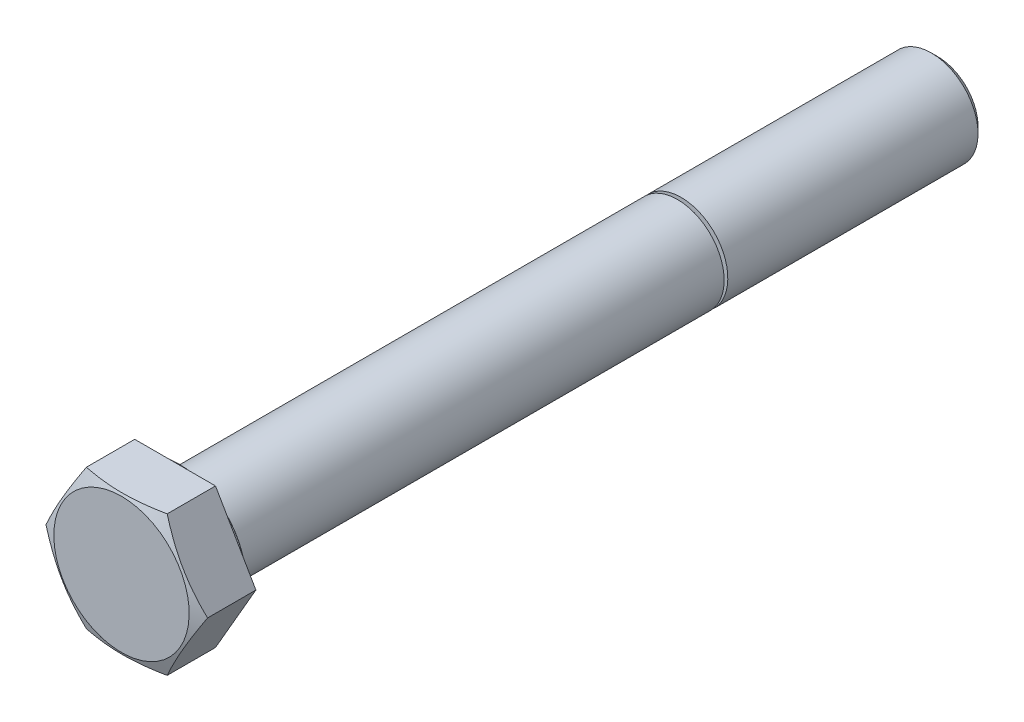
ISO-10303-21;
HEADER;
FILE_DESCRIPTION(('STEP AP214'),'2;1');
FILE_NAME('part.step','',(''),(''),'','','');
FILE_SCHEMA(('AUTOMOTIVE_DESIGN { 1 0 10303 214 1 1 1 1 }'));
ENDSEC;
DATA;
#1=APPLICATION_CONTEXT('core data for automotive mechanical design processes');
#2=APPLICATION_PROTOCOL_DEFINITION('international standard','automotive_design',2000,#1);
#3=PRODUCT_CONTEXT('',#1,'mechanical');
#4=PRODUCT('Part','Part','',(#3));
#5=PRODUCT_RELATED_PRODUCT_CATEGORY('part','',(#4));
#6=PRODUCT_DEFINITION_FORMATION('','',#4);
#7=PRODUCT_DEFINITION_CONTEXT('part definition',#1,'design');
#8=PRODUCT_DEFINITION('design','',#6,#7);
#9=PRODUCT_DEFINITION_SHAPE('','',#8);
#10=(LENGTH_UNIT() NAMED_UNIT(*) SI_UNIT(.MILLI.,.METRE.));
#11=(NAMED_UNIT(*) PLANE_ANGLE_UNIT() SI_UNIT($,.RADIAN.));
#12=(NAMED_UNIT(*) SI_UNIT($,.STERADIAN.) SOLID_ANGLE_UNIT());
#13=UNCERTAINTY_MEASURE_WITH_UNIT(LENGTH_MEASURE(1.E-05),#10,'distance_accuracy_value','');
#14=(GEOMETRIC_REPRESENTATION_CONTEXT(3) GLOBAL_UNCERTAINTY_ASSIGNED_CONTEXT((#13)) GLOBAL_UNIT_ASSIGNED_CONTEXT((#10,
#11,#12)) REPRESENTATION_CONTEXT('',''));
#15=CARTESIAN_POINT('',(0.,0.,0.));
#16=DIRECTION('',(0.,0.,1.));
#17=DIRECTION('',(1.,0.,0.));
#18=AXIS2_PLACEMENT_3D('',#15,#16,#17);
#19=CARTESIAN_POINT('',(0.,3.45875,-130.));
#20=DIRECTION('',(0.,0.,-1.));
#21=DIRECTION('',(0.,1.,0.));
#22=AXIS2_PLACEMENT_3D('',#19,#20,#21);
#23=PLANE('',#22);
#24=CARTESIAN_POINT('',(0.,0.,-130.));
#25=DIRECTION('',(0.,0.,-1.));
#26=DIRECTION('',(0.,1.,0.));
#27=AXIS2_PLACEMENT_3D('',#24,#25,#26);
#28=CIRCLE('',#27,6.9175);
#29=CARTESIAN_POINT('',(0.,6.9175,-130.));
#30=VERTEX_POINT('',#29);
#31=EDGE_CURVE('E11',#30,#30,#28,.T.);
#32=ORIENTED_EDGE('',*,*,#31,.T.);
#33=EDGE_LOOP('',(#32));
#34=FACE_BOUND('',#33,.T.);
#35=ADVANCED_FACE('F17',(#34),#23,.T.);
#36=CARTESIAN_POINT('',(0.,0.,-129.45875));
#37=DIRECTION('',(0.,0.,1.));
#38=DIRECTION('',(0.,1.,0.));
#39=AXIS2_PLACEMENT_3D('',#36,#37,#38);
#40=CONICAL_SURFACE('',#39,7.45875,0.785398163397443);
#41=CARTESIAN_POINT('',(0.,0.,-128.9175));
#42=DIRECTION('',(0.,0.,-1.));
#43=DIRECTION('',(0.,1.,0.));
#44=AXIS2_PLACEMENT_3D('',#41,#42,#43);
#45=CIRCLE('',#44,8.);
#46=CARTESIAN_POINT('',(0.,8.,-128.9175));
#47=VERTEX_POINT('',#46);
#48=EDGE_CURVE('E28',#47,#47,#45,.T.);
#49=ORIENTED_EDGE('',*,*,#48,.T.);
#50=EDGE_LOOP('',(#49));
#51=FACE_BOUND('',#50,.T.);
#52=ORIENTED_EDGE('',*,*,#31,.F.);
#53=EDGE_LOOP('',(#52));
#54=FACE_BOUND('',#53,.T.);
#55=ADVANCED_FACE('F259',(#51,#54),#40,.T.);
#56=CARTESIAN_POINT('',(0.,0.,-107.45875));
#57=DIRECTION('',(0.,0.,1.));
#58=DIRECTION('',(0.,1.,0.));
#59=AXIS2_PLACEMENT_3D('',#56,#57,#58);
#60=CYLINDRICAL_SURFACE('',#59,8.);
#61=CARTESIAN_POINT('',(0.,0.,-86.));
#62=DIRECTION('',(0.,0.,-1.));
#63=DIRECTION('',(0.,1.,0.));
#64=AXIS2_PLACEMENT_3D('',#61,#62,#63);
#65=CIRCLE('',#64,8.);
#66=CARTESIAN_POINT('',(0.,8.,-86.));
#67=VERTEX_POINT('',#66);
#68=EDGE_CURVE('E99',#67,#67,#65,.T.);
#69=ORIENTED_EDGE('',*,*,#68,.T.);
#70=EDGE_LOOP('',(#69));
#71=FACE_BOUND('',#70,.T.);
#72=ORIENTED_EDGE('',*,*,#48,.F.);
#73=EDGE_LOOP('',(#72));
#74=FACE_BOUND('',#73,.T.);
#75=ADVANCED_FACE('F245',(#71,#74),#60,.T.);
#76=CARTESIAN_POINT('',(0.,7.45875,-86.));
#77=DIRECTION('',(0.,0.,1.));
#78=DIRECTION('',(0.,-1.,0.));
#79=AXIS2_PLACEMENT_3D('',#76,#77,#78);
#80=PLANE('',#79);
#81=CARTESIAN_POINT('',(0.,0.,-86.));
#82=DIRECTION('',(0.,0.,-1.));
#83=DIRECTION('',(0.,1.,0.));
#84=AXIS2_PLACEMENT_3D('',#81,#82,#83);
#85=CIRCLE('',#84,6.9175);
#86=CARTESIAN_POINT('',(0.,6.9175,-86.));
#87=VERTEX_POINT('',#86);
#88=EDGE_CURVE('E94',#87,#87,#85,.T.);
#89=ORIENTED_EDGE('',*,*,#88,.T.);
#90=EDGE_LOOP('',(#89));
#91=FACE_BOUND('',#90,.T.);
#92=ORIENTED_EDGE('',*,*,#68,.F.);
#93=EDGE_LOOP('',(#92));
#94=FACE_BOUND('',#93,.T.);
#95=ADVANCED_FACE('F248',(#91,#94),#80,.T.);
#96=CARTESIAN_POINT('',(0.,0.,-85.6875091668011));
#97=DIRECTION('',(0.,0.,1.));
#98=DIRECTION('',(0.,1.,0.));
#99=AXIS2_PLACEMENT_3D('',#96,#97,#98);
#100=CONICAL_SURFACE('',#99,7.45875,1.0471975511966);
#101=CARTESIAN_POINT('',(0.,0.,-85.3750183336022));
#102=DIRECTION('',(0.,0.,-1.));
#103=DIRECTION('',(0.,1.,0.));
#104=AXIS2_PLACEMENT_3D('',#101,#102,#103);
#105=CIRCLE('',#104,8.);
#106=CARTESIAN_POINT('',(0.,8.,-85.3750183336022));
#107=VERTEX_POINT('',#106);
#108=EDGE_CURVE('E89',#107,#107,#105,.T.);
#109=ORIENTED_EDGE('',*,*,#108,.T.);
#110=EDGE_LOOP('',(#109));
#111=FACE_BOUND('',#110,.T.);
#112=ORIENTED_EDGE('',*,*,#88,.F.);
#113=EDGE_LOOP('',(#112));
#114=FACE_BOUND('',#113,.T.);
#115=ADVANCED_FACE('F90',(#111,#114),#100,.T.);
#116=CARTESIAN_POINT('',(0.,0.,-43.0875091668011));
#117=DIRECTION('',(0.,0.,1.));
#118=DIRECTION('',(0.,1.,0.));
#119=AXIS2_PLACEMENT_3D('',#116,#117,#118);
#120=CYLINDRICAL_SURFACE('',#119,8.);
#121=CARTESIAN_POINT('',(0.,0.,-0.8));
#122=DIRECTION('',(0.,0.,-1.));
#123=DIRECTION('',(0.,1.,0.));
#124=AXIS2_PLACEMENT_3D('',#121,#122,#123);
#125=CIRCLE('',#124,8.);
#126=CARTESIAN_POINT('',(0.,8.,-0.8));
#127=VERTEX_POINT('',#126);
#128=EDGE_CURVE('E85',#127,#127,#125,.T.);
#129=ORIENTED_EDGE('',*,*,#128,.T.);
#130=EDGE_LOOP('',(#129));
#131=FACE_BOUND('',#130,.T.);
#132=ORIENTED_EDGE('',*,*,#108,.F.);
#133=EDGE_LOOP('',(#132));
#134=FACE_BOUND('',#133,.T.);
#135=ADVANCED_FACE('F257',(#131,#134),#120,.T.);
#136=CARTESIAN_POINT('',(0.,0.,-0.8));
#137=DIRECTION('',(0.,0.,-1.));
#138=DIRECTION('',(-1.,0.,0.));
#139=AXIS2_PLACEMENT_3D('',#136,#137,#138);
#140=TOROIDAL_SURFACE('',#139,8.8,0.8);
#141=CARTESIAN_POINT('',(0.,0.,0.));
#142=DIRECTION('',(0.,0.,-1.));
#143=DIRECTION('',(0.,1.,0.));
#144=AXIS2_PLACEMENT_3D('',#141,#142,#143);
#145=CIRCLE('',#144,8.8);
#146=CARTESIAN_POINT('',(0.,8.8,0.));
#147=VERTEX_POINT('',#146);
#148=EDGE_CURVE('E101',#147,#147,#145,.T.);
#149=ORIENTED_EDGE('',*,*,#148,.T.);
#150=EDGE_LOOP('',(#149));
#151=FACE_BOUND('',#150,.T.);
#152=ORIENTED_EDGE('',*,*,#128,.F.);
#153=EDGE_LOOP('',(#152));
#154=FACE_BOUND('',#153,.T.);
#155=ADVANCED_FACE('F273',(#151,#154),#140,.F.);
#156=CARTESIAN_POINT('',(0.,9.9,0.));
#157=DIRECTION('',(0.,0.,-1.));
#158=DIRECTION('',(0.,1.,0.));
#159=AXIS2_PLACEMENT_3D('',#156,#157,#158);
#160=PLANE('',#159);
#161=CARTESIAN_POINT('',(0.,0.,0.));
#162=DIRECTION('',(0.,0.,-1.));
#163=DIRECTION('',(0.,1.,0.));
#164=AXIS2_PLACEMENT_3D('',#161,#162,#163);
#165=CIRCLE('',#164,11.);
#166=CARTESIAN_POINT('',(0.,11.,0.));
#167=VERTEX_POINT('',#166);
#168=EDGE_CURVE('E105',#167,#167,#165,.T.);
#169=ORIENTED_EDGE('',*,*,#168,.T.);
#170=EDGE_LOOP('',(#169));
#171=FACE_BOUND('',#170,.T.);
#172=ORIENTED_EDGE('',*,*,#148,.F.);
#173=EDGE_LOOP('',(#172));
#174=FACE_BOUND('',#173,.T.);
#175=ADVANCED_FACE('F276',(#171,#174),#160,.T.);
#176=CARTESIAN_POINT('',(0.,0.,0.8));
#177=DIRECTION('',(0.,0.,-1.));
#178=DIRECTION('',(-1.,0.,0.));
#179=AXIS2_PLACEMENT_3D('',#176,#177,#178);
#180=TOROIDAL_SURFACE('',#179,11.,0.8);
#181=CARTESIAN_POINT('',(0.,0.,0.8));
#182=DIRECTION('',(0.,0.,-1.));
#183=DIRECTION('',(0.,1.,0.));
#184=AXIS2_PLACEMENT_3D('',#181,#182,#183);
#185=CIRCLE('',#184,11.8);
#186=CARTESIAN_POINT('',(0.,11.8,0.8));
#187=VERTEX_POINT('',#186);
#188=EDGE_CURVE('E56',#187,#187,#185,.T.);
#189=ORIENTED_EDGE('',*,*,#188,.T.);
#190=EDGE_LOOP('',(#189));
#191=FACE_BOUND('',#190,.T.);
#192=ORIENTED_EDGE('',*,*,#168,.F.);
#193=EDGE_LOOP('',(#192));
#194=FACE_BOUND('',#193,.T.);
#195=ADVANCED_FACE('F284',(#191,#194),#180,.T.);
#196=CARTESIAN_POINT('',(0.,12.8282,0.8));
#197=DIRECTION('',(0.,0.,-1.));
#198=DIRECTION('',(0.,1.,0.));
#199=AXIS2_PLACEMENT_3D('',#196,#197,#198);
#200=PLANE('',#199);
#201=ORIENTED_EDGE('',*,*,#188,.F.);
#202=EDGE_LOOP('',(#201));
#203=FACE_BOUND('',#202,.T.);
#204=DIRECTION('',(0.5,-0.866025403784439,0.));
#205=VECTOR('',#204,1.);
#206=CARTESIAN_POINT('',(-13.1696867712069,-1.18942220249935,0.8));
#207=LINE('',#206,#205);
#208=CARTESIAN_POINT('',(-13.8564,0.,0.8));
#209=VERTEX_POINT('',#208);
#210=CARTESIAN_POINT('',(-6.9282,-11.9999944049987,0.8));
#211=VERTEX_POINT('',#210);
#212=EDGE_CURVE('E122',#209,#211,#207,.T.);
#213=ORIENTED_EDGE('',*,*,#212,.F.);
#214=DIRECTION('',(-0.5,-0.866025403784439,0.));
#215=VECTOR('',#214,1.);
#216=CARTESIAN_POINT('',(-7.61491322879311,10.8105722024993,0.8));
#217=LINE('',#216,#215);
#218=CARTESIAN_POINT('',(-6.9282,11.9999944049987,0.8));
#219=VERTEX_POINT('',#218);
#220=EDGE_CURVE('E21',#219,#209,#217,.T.);
#221=ORIENTED_EDGE('',*,*,#220,.F.);
#222=DIRECTION('',(-1.,0.,0.));
#223=VECTOR('',#222,1.);
#224=CARTESIAN_POINT('',(0.,11.9999944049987,0.8));
#225=LINE('',#224,#223);
#226=CARTESIAN_POINT('',(6.9282,11.9999944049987,0.8));
#227=VERTEX_POINT('',#226);
#228=EDGE_CURVE('E158',#227,#219,#225,.T.);
#229=ORIENTED_EDGE('',*,*,#228,.F.);
#230=DIRECTION('',(-0.5,0.866025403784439,0.));
#231=VECTOR('',#230,1.);
#232=CARTESIAN_POINT('',(7.61491322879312,10.8105722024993,0.8));
#233=LINE('',#232,#231);
#234=CARTESIAN_POINT('',(13.8564,0.,0.8));
#235=VERTEX_POINT('',#234);
#236=EDGE_CURVE('E131',#235,#227,#233,.T.);
#237=ORIENTED_EDGE('',*,*,#236,.F.);
#238=DIRECTION('',(0.5,0.866025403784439,0.));
#239=VECTOR('',#238,1.);
#240=CARTESIAN_POINT('',(13.1696867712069,-1.18942220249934,0.8));
#241=LINE('',#240,#239);
#242=CARTESIAN_POINT('',(6.9282,-11.9999944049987,0.8));
#243=VERTEX_POINT('',#242);
#244=EDGE_CURVE('E156',#243,#235,#241,.T.);
#245=ORIENTED_EDGE('',*,*,#244,.F.);
#246=DIRECTION('',(1.,0.,0.));
#247=VECTOR('',#246,1.);
#248=CARTESIAN_POINT('',(0.,-11.9999944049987,0.8));
#249=LINE('',#248,#247);
#250=EDGE_CURVE('E114',#211,#243,#249,.T.);
#251=ORIENTED_EDGE('',*,*,#250,.F.);
#252=EDGE_LOOP('',(#213,#221,#229,#237,#245,#251));
#253=FACE_BOUND('',#252,.T.);
#254=ADVANCED_FACE('F236',(#203,#253),#200,.T.);
#255=CARTESIAN_POINT('',(0.,0.,9.54545454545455));
#256=DIRECTION('',(0.,0.,-1.));
#257=DIRECTION('',(0.,1.,0.));
#258=AXIS2_PLACEMENT_3D('',#255,#256,#257);
#259=CONICAL_SURFACE('',#258,12.7313605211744,1.18682389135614);
#260=CARTESIAN_POINT('',(0.,0.,10.));
#261=DIRECTION('',(0.,0.,-1.));
#262=DIRECTION('',(0.,1.,0.));
#263=AXIS2_PLACEMENT_3D('',#260,#261,#262);
#264=CIRCLE('',#263,11.6063210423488);
#265=CARTESIAN_POINT('',(0.,11.6063210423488,10.));
#266=VERTEX_POINT('',#265);
#267=EDGE_CURVE('E63',#266,#266,#264,.T.);
#268=ORIENTED_EDGE('',*,*,#267,.T.);
#269=EDGE_LOOP('',(#268));
#270=FACE_BOUND('',#269,.T.);
#271=CARTESIAN_POINT('',(6.9282,-11.9999944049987,9.09090909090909));
#272=CARTESIAN_POINT('',(0.,-11.9999944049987,10.4904963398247));
#273=CARTESIAN_POINT('',(-6.9282,-11.9999944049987,9.09090909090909));
#274=(BOUNDED_CURVE() B_SPLINE_CURVE(2,(#271,#272,#273),.UNSPECIFIED.,.F.,
.F.) B_SPLINE_CURVE_WITH_KNOTS((3,3),(0.,13.9373613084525),
.UNSPECIFIED.) CURVE() GEOMETRIC_REPRESENTATION_ITEM() RATIONAL_B_SPLINE_CURVE((1.,
1.15470053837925,1.)) REPRESENTATION_ITEM(''));
#275=CARTESIAN_POINT('',(6.9282,-11.9999944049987,9.09090909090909));
#276=VERTEX_POINT('',#275);
#277=CARTESIAN_POINT('',(-6.9282,-11.9999944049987,9.09090909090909));
#278=VERTEX_POINT('',#277);
#279=EDGE_CURVE('E181',#276,#278,#274,.T.);
#280=ORIENTED_EDGE('',*,*,#279,.F.);
#281=CARTESIAN_POINT('',(13.8564,0.,9.09090909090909));
#282=CARTESIAN_POINT('',(10.3923,-5.99999720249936,10.4904963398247));
#283=CARTESIAN_POINT('',(6.9282,-11.9999944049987,9.09090909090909));
#284=(BOUNDED_CURVE() B_SPLINE_CURVE(2,(#281,#282,#283),.UNSPECIFIED.,.F.,
.F.) B_SPLINE_CURVE_WITH_KNOTS((3,3),(0.,13.9373613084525),
.UNSPECIFIED.) CURVE() GEOMETRIC_REPRESENTATION_ITEM() RATIONAL_B_SPLINE_CURVE((1.,
1.15470053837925,1.)) REPRESENTATION_ITEM(''));
#285=CARTESIAN_POINT('',(13.8564,0.,9.09090909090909));
#286=VERTEX_POINT('',#285);
#287=EDGE_CURVE('E139',#286,#276,#284,.T.);
#288=ORIENTED_EDGE('',*,*,#287,.F.);
#289=CARTESIAN_POINT('',(6.9282,11.9999944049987,9.09090909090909));
#290=CARTESIAN_POINT('',(10.3923,5.99999720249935,10.4904963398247));
#291=CARTESIAN_POINT('',(13.8564,0.,9.09090909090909));
#292=(BOUNDED_CURVE() B_SPLINE_CURVE(2,(#289,#290,#291),.UNSPECIFIED.,.F.,
.F.) B_SPLINE_CURVE_WITH_KNOTS((3,3),(0.,13.9373613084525),
.UNSPECIFIED.) CURVE() GEOMETRIC_REPRESENTATION_ITEM() RATIONAL_B_SPLINE_CURVE((1.,
1.15470053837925,1.)) REPRESENTATION_ITEM(''));
#293=CARTESIAN_POINT('',(6.9282,11.9999944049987,9.09090909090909));
#294=VERTEX_POINT('',#293);
#295=EDGE_CURVE('E127',#294,#286,#292,.T.);
#296=ORIENTED_EDGE('',*,*,#295,.F.);
#297=CARTESIAN_POINT('',(-6.9282,11.9999944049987,9.09090909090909));
#298=CARTESIAN_POINT('',(0.,11.9999944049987,10.4904963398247));
#299=CARTESIAN_POINT('',(6.9282,11.9999944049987,9.09090909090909));
#300=(BOUNDED_CURVE() B_SPLINE_CURVE(2,(#297,#298,#299),.UNSPECIFIED.,.F.,
.F.) B_SPLINE_CURVE_WITH_KNOTS((3,3),(0.,13.9373613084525),
.UNSPECIFIED.) CURVE() GEOMETRIC_REPRESENTATION_ITEM() RATIONAL_B_SPLINE_CURVE((1.,
1.15470053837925,1.)) REPRESENTATION_ITEM(''));
#301=CARTESIAN_POINT('',(-6.9282,11.9999944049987,9.09090909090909));
#302=VERTEX_POINT('',#301);
#303=EDGE_CURVE('E169',#302,#294,#300,.T.);
#304=ORIENTED_EDGE('',*,*,#303,.F.);
#305=CARTESIAN_POINT('',(-13.8564,0.,9.09090909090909));
#306=CARTESIAN_POINT('',(-10.3923,5.99999720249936,10.4904963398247));
#307=CARTESIAN_POINT('',(-6.9282,11.9999944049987,9.09090909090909));
#308=(BOUNDED_CURVE() B_SPLINE_CURVE(2,(#305,#306,#307),.UNSPECIFIED.,.F.,
.F.) B_SPLINE_CURVE_WITH_KNOTS((3,3),(0.,13.9373613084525),
.UNSPECIFIED.) CURVE() GEOMETRIC_REPRESENTATION_ITEM() RATIONAL_B_SPLINE_CURVE((1.,
1.15470053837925,1.)) REPRESENTATION_ITEM(''));
#309=CARTESIAN_POINT('',(-13.8564,0.,9.09090909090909));
#310=VERTEX_POINT('',#309);
#311=EDGE_CURVE('E125',#310,#302,#308,.T.);
#312=ORIENTED_EDGE('',*,*,#311,.F.);
#313=CARTESIAN_POINT('',(-6.9282,-11.9999944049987,9.09090909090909));
#314=CARTESIAN_POINT('',(-10.3923,-5.99999720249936,10.4904963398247));
#315=CARTESIAN_POINT('',(-13.8564,0.,9.09090909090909));
#316=(BOUNDED_CURVE() B_SPLINE_CURVE(2,(#313,#314,#315),.UNSPECIFIED.,.F.,
.F.) B_SPLINE_CURVE_WITH_KNOTS((3,3),(0.,13.9373613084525),
.UNSPECIFIED.) CURVE() GEOMETRIC_REPRESENTATION_ITEM() RATIONAL_B_SPLINE_CURVE((1.,
1.15470053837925,1.)) REPRESENTATION_ITEM(''));
#317=EDGE_CURVE('E109',#278,#310,#316,.T.);
#318=ORIENTED_EDGE('',*,*,#317,.F.);
#319=EDGE_LOOP('',(#280,#288,#296,#304,#312,#318));
#320=FACE_BOUND('',#319,.T.);
#321=ADVANCED_FACE('F19',(#270,#320),#259,.T.);
#322=CARTESIAN_POINT('',(0.,5.80316052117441,10.));
#323=DIRECTION('',(0.,0.,1.));
#324=DIRECTION('',(0.,-1.,0.));
#325=AXIS2_PLACEMENT_3D('',#322,#323,#324);
#326=PLANE('',#325);
#327=ORIENTED_EDGE('',*,*,#267,.F.);
#328=EDGE_LOOP('',(#327));
#329=FACE_BOUND('',#328,.T.);
#330=ADVANCED_FACE('F293',(#329),#326,.T.);
#331=CARTESIAN_POINT('',(10.3923,5.99999720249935,10.));
#332=DIRECTION('',(0.866025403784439,0.5,0.));
#333=DIRECTION('',(0.5,-0.866025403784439,0.));
#334=AXIS2_PLACEMENT_3D('',#331,#332,#333);
#335=PLANE('',#334);
#336=ORIENTED_EDGE('',*,*,#236,.T.);
#337=DIRECTION('',(0.,0.,1.));
#338=VECTOR('',#337,1.);
#339=CARTESIAN_POINT('',(6.9282,11.9999944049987,4.94545454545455));
#340=LINE('',#339,#338);
#341=EDGE_CURVE('E175',#227,#294,#340,.T.);
#342=ORIENTED_EDGE('',*,*,#341,.T.);
#343=ORIENTED_EDGE('',*,*,#295,.T.);
#344=DIRECTION('',(0.,0.,1.));
#345=VECTOR('',#344,1.);
#346=CARTESIAN_POINT('',(13.8564,0.,4.94545454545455));
#347=LINE('',#346,#345);
#348=EDGE_CURVE('E153',#235,#286,#347,.T.);
#349=ORIENTED_EDGE('',*,*,#348,.F.);
#350=EDGE_LOOP('',(#336,#342,#343,#349));
#351=FACE_BOUND('',#350,.T.);
#352=ADVANCED_FACE('F287',(#351),#335,.T.);
#353=CARTESIAN_POINT('',(10.3923,-5.99999720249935,10.));
#354=DIRECTION('',(0.866025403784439,-0.5,0.));
#355=DIRECTION('',(-0.5,-0.866025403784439,0.));
#356=AXIS2_PLACEMENT_3D('',#353,#354,#355);
#357=PLANE('',#356);
#358=ORIENTED_EDGE('',*,*,#244,.T.);
#359=ORIENTED_EDGE('',*,*,#348,.T.);
#360=ORIENTED_EDGE('',*,*,#287,.T.);
#361=DIRECTION('',(0.,0.,1.));
#362=VECTOR('',#361,1.);
#363=CARTESIAN_POINT('',(6.9282,-11.9999944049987,4.94545454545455));
#364=LINE('',#363,#362);
#365=EDGE_CURVE('E185',#243,#276,#364,.T.);
#366=ORIENTED_EDGE('',*,*,#365,.F.);
#367=EDGE_LOOP('',(#358,#359,#360,#366));
#368=FACE_BOUND('',#367,.T.);
#369=ADVANCED_FACE('F199',(#368),#357,.T.);
#370=CARTESIAN_POINT('',(0.,-11.9999944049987,10.));
#371=DIRECTION('',(0.,-1.,0.));
#372=DIRECTION('',(-1.,0.,0.));
#373=AXIS2_PLACEMENT_3D('',#370,#371,#372);
#374=PLANE('',#373);
#375=ORIENTED_EDGE('',*,*,#250,.T.);
#376=ORIENTED_EDGE('',*,*,#365,.T.);
#377=ORIENTED_EDGE('',*,*,#279,.T.);
#378=DIRECTION('',(0.,0.,1.));
#379=VECTOR('',#378,1.);
#380=CARTESIAN_POINT('',(-6.9282,-11.9999944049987,4.94545454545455));
#381=LINE('',#380,#379);
#382=EDGE_CURVE('E115',#211,#278,#381,.T.);
#383=ORIENTED_EDGE('',*,*,#382,.F.);
#384=EDGE_LOOP('',(#375,#376,#377,#383));
#385=FACE_BOUND('',#384,.T.);
#386=ADVANCED_FACE('F207',(#385),#374,.T.);
#387=CARTESIAN_POINT('',(-10.3923,-5.99999720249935,10.));
#388=DIRECTION('',(-0.866025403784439,-0.5,0.));
#389=DIRECTION('',(-0.5,0.866025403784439,0.));
#390=AXIS2_PLACEMENT_3D('',#387,#388,#389);
#391=PLANE('',#390);
#392=ORIENTED_EDGE('',*,*,#212,.T.);
#393=ORIENTED_EDGE('',*,*,#382,.T.);
#394=ORIENTED_EDGE('',*,*,#317,.T.);
#395=DIRECTION('',(0.,0.,-1.));
#396=VECTOR('',#395,1.);
#397=CARTESIAN_POINT('',(-13.8564,0.,4.94545454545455));
#398=LINE('',#397,#396);
#399=EDGE_CURVE('E145',#310,#209,#398,.T.);
#400=ORIENTED_EDGE('',*,*,#399,.T.);
#401=EDGE_LOOP('',(#392,#393,#394,#400));
#402=FACE_BOUND('',#401,.T.);
#403=ADVANCED_FACE('F270',(#402),#391,.T.);
#404=CARTESIAN_POINT('',(-10.3923,5.99999720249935,10.));
#405=DIRECTION('',(-0.866025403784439,0.5,0.));
#406=DIRECTION('',(0.5,0.866025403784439,0.));
#407=AXIS2_PLACEMENT_3D('',#404,#405,#406);
#408=PLANE('',#407);
#409=ORIENTED_EDGE('',*,*,#220,.T.);
#410=ORIENTED_EDGE('',*,*,#399,.F.);
#411=ORIENTED_EDGE('',*,*,#311,.T.);
#412=DIRECTION('',(0.,0.,1.));
#413=VECTOR('',#412,1.);
#414=CARTESIAN_POINT('',(-6.9282,11.9999944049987,4.94545454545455));
#415=LINE('',#414,#413);
#416=EDGE_CURVE('E162',#219,#302,#415,.T.);
#417=ORIENTED_EDGE('',*,*,#416,.F.);
#418=EDGE_LOOP('',(#409,#410,#411,#417));
#419=FACE_BOUND('',#418,.T.);
#420=ADVANCED_FACE('F231',(#419),#408,.T.);
#421=CARTESIAN_POINT('',(0.,11.9999944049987,10.));
#422=DIRECTION('',(0.,1.,0.));
#423=DIRECTION('',(1.,0.,0.));
#424=AXIS2_PLACEMENT_3D('',#421,#422,#423);
#425=PLANE('',#424);
#426=ORIENTED_EDGE('',*,*,#228,.T.);
#427=ORIENTED_EDGE('',*,*,#416,.T.);
#428=ORIENTED_EDGE('',*,*,#303,.T.);
#429=ORIENTED_EDGE('',*,*,#341,.F.);
#430=EDGE_LOOP('',(#426,#427,#428,#429));
#431=FACE_BOUND('',#430,.T.);
#432=ADVANCED_FACE('F280',(#431),#425,.T.);
#433=CLOSED_SHELL('',(#35,#55,#75,#95,#115,#135,#155,#175,#195,#254,#321,#330,#352,#369,#386,
#403,#420,#432));
#434=MANIFOLD_SOLID_BREP('B1',#433);
#435=ADVANCED_BREP_SHAPE_REPRESENTATION('',(#18,#434),#14);
#436=SHAPE_DEFINITION_REPRESENTATION(#9,#435);
ENDSEC;
END-ISO-10303-21;
